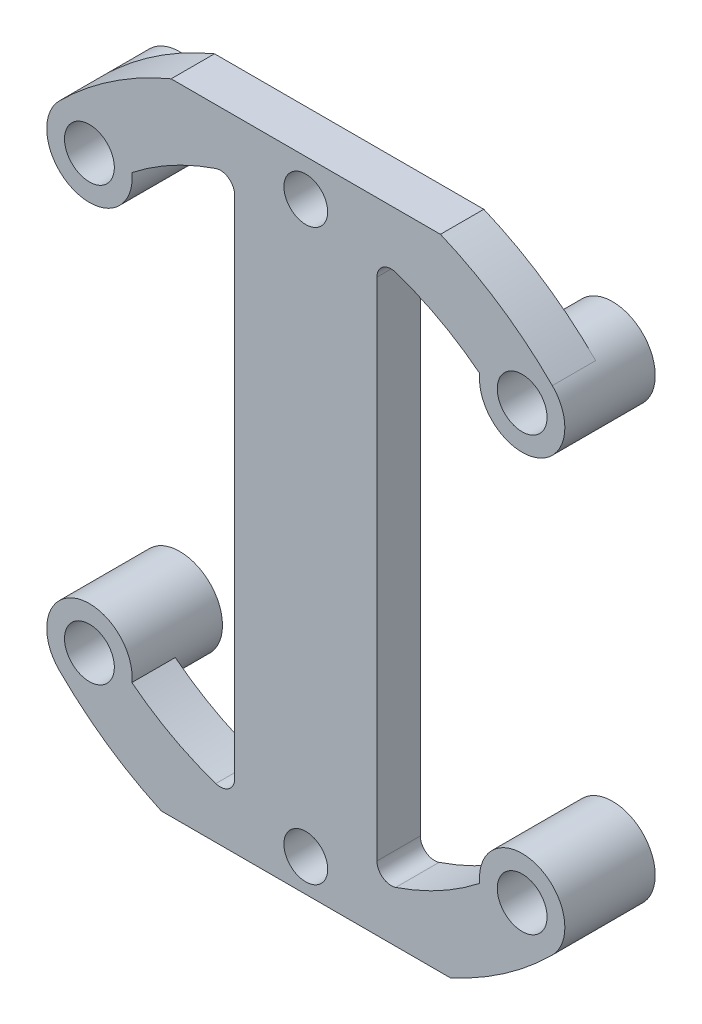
from build123d import *

# Parameters (mm, degrees)
SKETCH1_R           = 1.5367
SKETCH1_R_2         = 1.75
BOSS_EXTRUDE1_DEPTH = 3.048
CUT_EXTRUDE2_DEPTH  = 32.166789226
SKETCH3_R           = 3
SKETCH3_R_2         = 1.76754924
SKETCH3_R_3         = 1.798499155
SKETCH3_R_4         = 1.75
BOSS_EXTRUDE2_DEPTH = 6.35
FILLET1_R           = 1
FILLET2_R           = 1
FILLET3_R           = 1
FILLET4_R           = 1


with BuildPart() as part:
    # Sketch1 → Boss-Extrude1 (new body)
    with BuildSketch(Plane.XY):
        with BuildLine():
            Line((-10.153360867, -22.297068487), (10.153360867, -22.297068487))
            ThreePointArc((10.153360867, -22.297068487), (16.490445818, -18.1194701), (21.24480583, -12.202795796))
            Line((21.24480583, -12.202795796), (5, -12.202795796))
            Line((5, -12.202795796), (5, 12.202795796))
            Line((5, 12.202795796), (21.24480583, 12.202795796))
            ThreePointArc((21.24480583, 12.202795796), (16.2091544, 18.371535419), (9.461148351, 22.599483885))
            Line((9.461148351, 22.599483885), (-9.461148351, 22.599483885))
            ThreePointArc((-9.461148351, 22.599483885), (-16.2091544, 18.371535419), (-21.24480583, 12.202795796))
            Line((-21.24480583, 12.202795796), (-5, 12.202795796))
            Line((-5, 12.202795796), (-5, -12.202795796))
            Line((-5, -12.202795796), (-21.24480583, -12.202795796))
            ThreePointArc((-21.24480583, -12.202795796), (-16.490445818, -18.1194701), (-10.153360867, -22.297068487))
        make_face()
        with Locations(Location((0, 20, 0), (0, 0, 180))):
            Circle(SKETCH1_R, mode=Mode.SUBTRACT)
        with Locations(Location((0, -20, 0), (0, 0, 180))):
            Circle(SKETCH1_R, mode=Mode.SUBTRACT)
        with Locations(Location((15.202795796, 15.202795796, 0), (0, 0, 180))):
            Circle(SKETCH1_R_2, mode=Mode.SUBTRACT)
        with Locations(Location((15.202795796, -15.202795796, 0), (0, 0, 180))):
            Circle(SKETCH1_R_2, mode=Mode.SUBTRACT)
        with Locations(Location((-15.202795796, -15.202795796, 0), (0, 0, 180))):
            Circle(SKETCH1_R_2, mode=Mode.SUBTRACT)
        with Locations(Location((-15.202795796, 15.202795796, 0), (0, 0, 180))):
            Circle(SKETCH1_R_2, mode=Mode.SUBTRACT)
    extrude(amount=BOSS_EXTRUDE1_DEPTH)

    # Sketch2 → Cut-Extrude2 (cut, through all)
    with BuildSketch(Plane.XY.offset(3.048)):
        with BuildLine():
            Line((5, 19.106608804), (5, -19.106608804))
            ThreePointArc((5, -19.106608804), (8.794773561, -17.683734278), (12.219213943, -15.516227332))
            ThreePointArc((12.219213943, -15.516227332), (16.204289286, -12.374897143), (17.324116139, -17.324116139))
            ThreePointArc((17.324116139, -17.324116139), (24.5, 0), (17.324116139, 17.324116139))
            ThreePointArc((17.324116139, 17.324116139), (16.204289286, 12.374897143), (12.219213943, 15.516227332))
            ThreePointArc((12.219213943, 15.516227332), (8.794773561, 17.683734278), (5, 19.106608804))
        make_face()
        with BuildLine():
            Line((-5, 19.106608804), (-5, -19.106608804))
            ThreePointArc((-5, -19.106608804), (-8.794773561, -17.683734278), (-12.219213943, -15.516227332))
            ThreePointArc((-12.219213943, -15.516227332), (-16.204289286, -12.374897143), (-17.324116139, -17.324116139))
            ThreePointArc((-17.324116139, -17.324116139), (-24.5, 0), (-17.324116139, 17.324116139))
            ThreePointArc((-17.324116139, 17.324116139), (-16.204289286, 12.374897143), (-12.219213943, 15.516227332))
            ThreePointArc((-12.219213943, 15.516227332), (-8.794773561, 17.683734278), (-5, 19.106608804))
        make_face()
    extrude(amount=-CUT_EXTRUDE2_DEPTH, mode=Mode.SUBTRACT)

    # Sketch3 → Boss-Extrude2 (add)
    # profile 1 of 4: a face of its own
    with BuildSketch(Plane.XY.offset(3.048)):
        with Locations((-15.202795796, -15.202795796)):
            Circle(SKETCH3_R)
        with Locations((-15.202795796, -15.202795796)):
            Circle(SKETCH3_R_2, mode=Mode.SUBTRACT)
    # profile 2 of 4: a face of its own
    with BuildSketch(Plane.XY.offset(3.048)):
        with Locations((-15.202795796, 15.202795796)):
            Circle(SKETCH3_R)
        with Locations((-15.202795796, 15.202795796)):
            Circle(SKETCH3_R_3, mode=Mode.SUBTRACT)
    # profile 3 of 4: a face of its own
    with BuildSketch(Plane.XY.offset(3.048)):
        with Locations((15.202795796, 15.202795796)):
            Circle(SKETCH3_R)
        with Locations(Location((15.202795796, 15.202795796, 0), (0, 0, 180))):
            Circle(SKETCH3_R_4, mode=Mode.SUBTRACT)
    # profile 4 of 4: a face of its own
    with BuildSketch(Plane.XY.offset(3.048)):
        with Locations((15.202795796, -15.202795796)):
            Circle(SKETCH3_R)
        with Locations(Location((15.202795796, -15.202795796, 0), (0, 0, 180))):
            Circle(SKETCH3_R_4, mode=Mode.SUBTRACT)
    extrude(amount=-BOSS_EXTRUDE2_DEPTH)

    # Fillet1
    fillet1_edges = [part.edges().sort_by_distance(p)[0] for p in [
        (-5, 19.106608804, 1.524),
    ]]
    fillet(fillet1_edges, radius=FILLET1_R)

    # Fillet2
    fillet2_edges = [part.edges().sort_by_distance(p)[0] for p in [
        (5, 19.106608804, 1.524),
    ]]
    fillet(fillet2_edges, radius=FILLET2_R)

    # Fillet3
    fillet3_edges = [part.edges().sort_by_distance(p)[0] for p in [
        (5, -19.106608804, 1.524),
    ]]
    fillet(fillet3_edges, radius=FILLET3_R)

    # Fillet4
    fillet4_edges = [part.edges().sort_by_distance(p)[0] for p in [
        (-5, -19.106608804, 1.524),
    ]]
    fillet(fillet4_edges, radius=FILLET4_R)


solid = part.part
